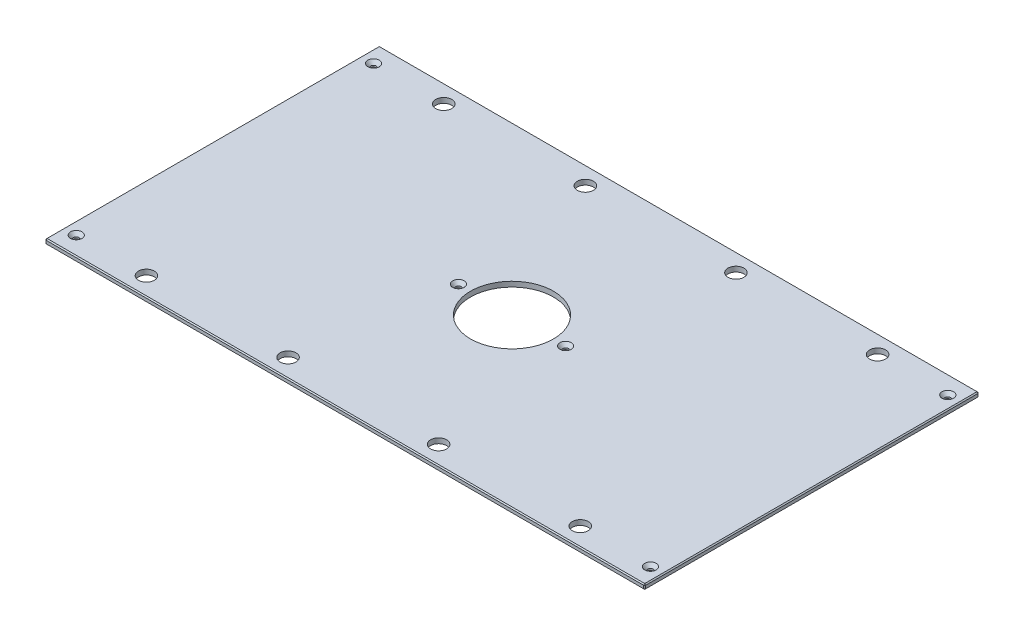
from build123d import *

# Parameters (mm, degrees)
SKETCH1_W                                     = 746.125
SKETCH1_H                                     = 415.925
BOSS_EXTRUDE1_DEPTH                           = 6.35
SKETCH13_R                                    = 51.562
CUT_EXTRUDE6_DEPTH                            = 428.158463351
F_25_32_0_78125_DIAMETER_HOLE1_D              = 19.84375
CHAMFER2_SIZE                                 = 1.27
CSK_FOR_1_4_FLAT_HEAD_MACHINE_SCREW1_AT_COUNT = 2
CSK_FOR_1_4_FLAT_HEAD_MACHINE_SCREW1_AT_PITCH = 369.88496
CSK_FOR_1_4_FLAT_HEAD_MACHINE_SCREW1_2_COUNT  = 2
CSK_FOR_1_4_FLAT_HEAD_MACHINE_SCREW1_2_PITCH  = 804.454177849
CSK_FOR_1_4_FLAT_HEAD_MACHINE_SCREW1_3_COUNT  = 2
CSK_FOR_1_4_FLAT_HEAD_MACHINE_SCREW1_3_PITCH  = 462.453392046
CSK_FOR_1_4_FLAT_HEAD_MACHINE_SCREW1_4_COUNT  = 2
CSK_FOR_1_4_FLAT_HEAD_MACHINE_SCREW1_4_PITCH  = 344.385298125
CSK_FOR_1_4_FLAT_HEAD_MACHINE_SCREW1_5_COUNT  = 2
CSK_FOR_1_4_FLAT_HEAD_MACHINE_SCREW1_5_PITCH  = 714.375
CSK_FOR_1_4_FLAT_HEAD_MACHINE_SCREW1_6_COUNT  = 2
CSK_FOR_1_4_FLAT_HEAD_MACHINE_SCREW1_6_PITCH  = 627.0625
CSK_FOR_1_4_FLAT_HEAD_MACHINE_SCREW1_7_COUNT  = 2
CSK_FOR_1_4_FLAT_HEAD_MACHINE_SCREW1_7_PITCH  = 728.026278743


with BuildPart() as part:
    # Sketch1 → Boss-Extrude1 (new body)
    with BuildSketch(Plane(origin=(0, 0, 0), x_dir=(1, 0, 0), z_dir=(0, 1, 0))):
        Rectangle(SKETCH1_W, SKETCH1_H)
    extrude(amount=BOSS_EXTRUDE1_DEPTH)

    # Sketch13 → Cut-Extrude6 (cut, through all)
    with BuildSketch(Plane(origin=(0, 6.35, 0), x_dir=(1, 0, 0), z_dir=(0, 1, 0))):
        with Locations(Location((0, 0, 0), (0, 0, 270))):
            Circle(SKETCH13_R)
    extrude(amount=-CUT_EXTRUDE6_DEPTH, mode=Mode.SUBTRACT)

    # 25_32 _0.78125_ Diameter Hole1 (through all)
    with Locations(Plane(origin=(0, 6.35, 0), x_dir=(1, 0, 0), z_dir=(0, 1, 0))):
        with Locations((269.875, 184.94248), (-269.875, 184.94248), (269.875, -184.94248), (-269.875, -184.94248), (-93.6625, 184.94248), (93.6625, 184.94248), (93.6625, -184.94248), (-93.6625, -184.94248)):
            Hole(F_25_32_0_78125_DIAMETER_HOLE1_D / 2)

    # Chamfer2
    chamfer2_edges = [part.edges().sort_by_distance(p)[0] for p in [
        (373.0625, 6.35, 0),
        (0, 6.35, -207.9625),
        (-373.0625, 6.35, 0),
        (0, 0, -207.9625),
        (373.0625, 0, 0),
        (0, 0, 207.9625),
        (-373.0625, 0, 0),
        (0, 6.35, 207.9625),
        (-373.0625, 3.175, -207.9625),
        (373.0625, 3.175, -207.9625),
        (373.0625, 3.175, 207.9625),
        (-373.0625, 3.175, 207.9625),
    ]]
    chamfer(chamfer2_edges, length=CHAMFER2_SIZE)

    # Sketch24 → CSK for 1_4 Flat Head Machine Screw1 (revolve, cut)
    with BuildSketch(Plane(origin=(357.1875, 6.35, -184.94248), x_dir=(0, 0, 1), z_dir=(1, 0, 0))):
        Polygon((0, 0), (0, 6.35), (3.3782, 6.35), (3.3782, 4.324464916), (7.1374, 0), align=None)
    csk_for_1_4_flat_head_machine_screw1 = revolve(axis=Axis((357.1875, 12.7, -184.94248), (0, -1, 0)), mode=Mode.SUBTRACT)

    # CSK for 1_4 Flat Head Machine Screw1 at: CSK for 1_4 Flat Head Machine Screw1 ×2
    with Locations(*[(0, 0, i * CSK_FOR_1_4_FLAT_HEAD_MACHINE_SCREW1_AT_PITCH) for i in range(1, CSK_FOR_1_4_FLAT_HEAD_MACHINE_SCREW1_AT_COUNT)]):
        add(csk_for_1_4_flat_head_machine_screw1, mode=Mode.SUBTRACT)

    # CSK for 1_4 Flat Head Machine Screw1 2: CSK for 1_4 Flat Head Machine Screw1 ×2
    with Locations(*[Vector(-0.888024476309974, 0, 0.459796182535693) * (i * CSK_FOR_1_4_FLAT_HEAD_MACHINE_SCREW1_2_PITCH) for i in range(1, CSK_FOR_1_4_FLAT_HEAD_MACHINE_SCREW1_2_COUNT)]):
        add(csk_for_1_4_flat_head_machine_screw1, mode=Mode.SUBTRACT)

    # CSK for 1_4 Flat Head Machine Screw1 3: CSK for 1_4 Flat Head Machine Screw1 ×2
    with Locations(*[Vector(-0.9165518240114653, 0, 0.39991593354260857) * (i * CSK_FOR_1_4_FLAT_HEAD_MACHINE_SCREW1_3_PITCH) for i in range(1, CSK_FOR_1_4_FLAT_HEAD_MACHINE_SCREW1_3_COUNT)]):
        add(csk_for_1_4_flat_head_machine_screw1, mode=Mode.SUBTRACT)

    # CSK for 1_4 Flat Head Machine Screw1 4: CSK for 1_4 Flat Head Machine Screw1 ×2
    with Locations(*[Vector(-0.8435682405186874, 0, 0.5370219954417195) * (i * CSK_FOR_1_4_FLAT_HEAD_MACHINE_SCREW1_4_PITCH) for i in range(1, CSK_FOR_1_4_FLAT_HEAD_MACHINE_SCREW1_4_COUNT)]):
        add(csk_for_1_4_flat_head_machine_screw1, mode=Mode.SUBTRACT)

    # CSK for 1_4 Flat Head Machine Screw1 5: CSK for 1_4 Flat Head Machine Screw1 ×2
    with Locations(*[(-i * CSK_FOR_1_4_FLAT_HEAD_MACHINE_SCREW1_5_PITCH, 0, 0) for i in range(1, CSK_FOR_1_4_FLAT_HEAD_MACHINE_SCREW1_5_COUNT)]):
        add(csk_for_1_4_flat_head_machine_screw1, mode=Mode.SUBTRACT)

    # CSK for 1_4 Flat Head Machine Screw1 6: CSK for 1_4 Flat Head Machine Screw1 ×2
    with Locations(*[(-i * CSK_FOR_1_4_FLAT_HEAD_MACHINE_SCREW1_6_PITCH, 0, 0) for i in range(1, CSK_FOR_1_4_FLAT_HEAD_MACHINE_SCREW1_6_COUNT)]):
        add(csk_for_1_4_flat_head_machine_screw1, mode=Mode.SUBTRACT)

    # CSK for 1_4 Flat Head Machine Screw1 7: CSK for 1_4 Flat Head Machine Screw1 ×2
    with Locations(*[Vector(-0.8613184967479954, 0, 0.508065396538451) * (i * CSK_FOR_1_4_FLAT_HEAD_MACHINE_SCREW1_7_PITCH) for i in range(1, CSK_FOR_1_4_FLAT_HEAD_MACHINE_SCREW1_7_COUNT)]):
        add(csk_for_1_4_flat_head_machine_screw1, mode=Mode.SUBTRACT)


solid = part.part
